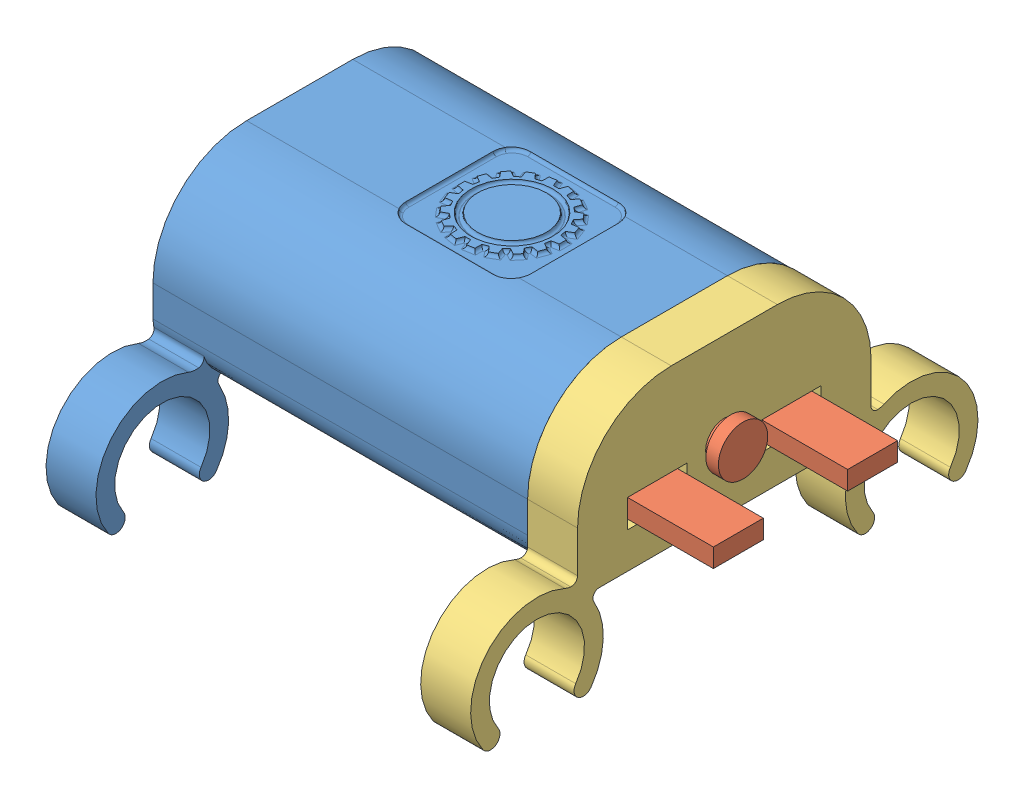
SolidWorks assembly BM Assy.SLDASM, configuration Default (file format 7000). Lengths in mm.
Overall size (81 38.84 81.25).
3 component instances, 3 part files, 6 mates.
Components (placement in the parent):
- Blend Micro Box-1: Blend Micro Box.SLDPRT [Default] at (-35.779 5.7274 -0.0081) x (0 0 -1) z (0 -1 0) size (81.25 60 38.84)
- Blend Micro PCB V3-2: Blend Micro PCB V3.SLDPRT [Default] at (0.221 -0.2726 -0.0081) size (76.75 16 40)
- Blend Micro Box Lid-1: Blend Micro Box Lid.SLDPRT [Default] at (32.221 5.7274 -0.0081) x (0 0 1) z (0 -1 0) size (81.25 11 38.8)
Mates (geometry in assembly coordinates):
- Distance4: distance = 63 mm aligned: plane of Blend Micro PCB V3-2 through (30.221 -1.7726 19.9919) normal (1 0 0); plane of Blend Micro Box-1 through (-32.779 5.7274 -0.0081) normal (1 0 0)
- Distance6: distance = 2 mm anti-aligned: plane of Blend Micro PCB V3-2 through (0.221 -1.7726 -0.0081) normal (0 -1 0); plane of Blend Micro Box-1 through (24.221 -3.7726 23.4919) normal (0 1 0)
- Coincident8: coincident anti-aligned: circle of Blend Micro Box-1; plane of Blend Micro Box Lid-1 through (24.221 5.7274 -0.0081) normal (-1 0 0)
- Concentric5: concentric anti-aligned: cylinder of Blend Micro Box-1 through (-27.779 -13.7726 -30.0081) axis (-1 0 0) radius 7.625; cylinder of Blend Micro Box Lid-1 through (24.221 -13.7726 -30.0081) axis (1 0 0) radius 7.625
- Concentric6: concentric anti-aligned: cylinder of Blend Micro Box-1 through (-27.779 -13.7726 29.9919) axis (-1 0 0) radius 7.625; cylinder of Blend Micro Box Lid-1 through (24.221 -13.7726 29.9919) axis (1 0 0) radius 7.625
- Distance8: distance = 0.5 mm anti-aligned: plane of Blend Micro PCB V3-2 through (-29.779 -1.7726 -20.0081) normal (0 0 -1); plane of Blend Micro Box-1 through (24.221 -6.7726 -20.5081) normal (0 0 1)
